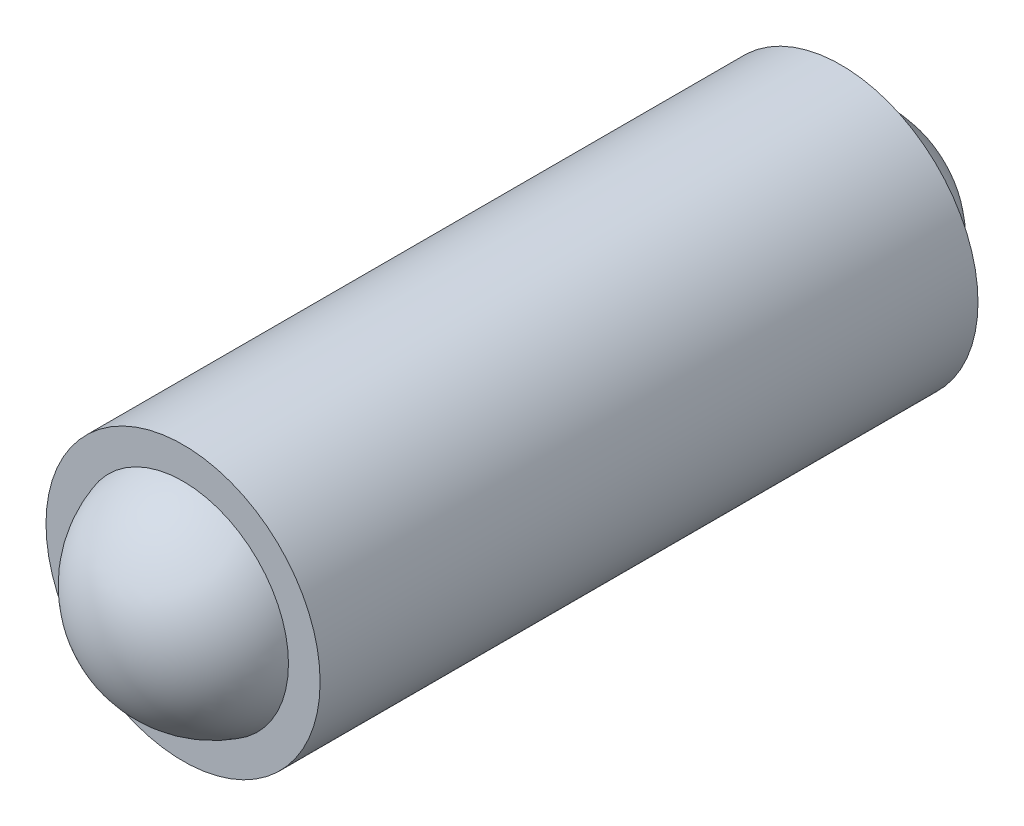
ISO-10303-21;
HEADER;
FILE_DESCRIPTION(('STEP AP214'),'2;1');
FILE_NAME('part.step','',(''),(''),'','','');
FILE_SCHEMA(('AUTOMOTIVE_DESIGN { 1 0 10303 214 1 1 1 1 }'));
ENDSEC;
DATA;
#1=APPLICATION_CONTEXT('core data for automotive mechanical design processes');
#2=APPLICATION_PROTOCOL_DEFINITION('international standard','automotive_design',2000,#1);
#3=PRODUCT_CONTEXT('',#1,'mechanical');
#4=PRODUCT('Part','Part','',(#3));
#5=PRODUCT_RELATED_PRODUCT_CATEGORY('part','',(#4));
#6=PRODUCT_DEFINITION_FORMATION('','',#4);
#7=PRODUCT_DEFINITION_CONTEXT('part definition',#1,'design');
#8=PRODUCT_DEFINITION('design','',#6,#7);
#9=PRODUCT_DEFINITION_SHAPE('','',#8);
#10=(LENGTH_UNIT() NAMED_UNIT(*) SI_UNIT(.MILLI.,.METRE.));
#11=(NAMED_UNIT(*) PLANE_ANGLE_UNIT() SI_UNIT($,.RADIAN.));
#12=(NAMED_UNIT(*) SI_UNIT($,.STERADIAN.) SOLID_ANGLE_UNIT());
#13=UNCERTAINTY_MEASURE_WITH_UNIT(LENGTH_MEASURE(1.E-05),#10,'distance_accuracy_value','');
#14=(GEOMETRIC_REPRESENTATION_CONTEXT(3) GLOBAL_UNCERTAINTY_ASSIGNED_CONTEXT((#13)) GLOBAL_UNIT_ASSIGNED_CONTEXT((#10,
#11,#12)) REPRESENTATION_CONTEXT('',''));
#15=CARTESIAN_POINT('',(0.,0.,0.));
#16=DIRECTION('',(0.,0.,1.));
#17=DIRECTION('',(1.,0.,0.));
#18=AXIS2_PLACEMENT_3D('',#15,#16,#17);
#19=CARTESIAN_POINT('',(0.,0.,-10.9));
#20=DIRECTION('',(0.,0.,1.));
#21=DIRECTION('',(0.,-1.,0.));
#22=AXIS2_PLACEMENT_3D('',#19,#20,#21);
#23=SPHERICAL_SURFACE('',#22,4.);
#24=CARTESIAN_POINT('',(0.,0.,-12.));
#25=DIRECTION('',(0.,0.,1.));
#26=DIRECTION('',(1.,0.,0.));
#27=AXIS2_PLACEMENT_3D('',#24,#25,#26);
#28=CIRCLE('',#27,3.84577690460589);
#29=CARTESIAN_POINT('',(3.84577690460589,0.,-12.));
#30=VERTEX_POINT('',#29);
#31=EDGE_CURVE('E26',#30,#30,#28,.T.);
#32=ORIENTED_EDGE('',*,*,#31,.F.);
#33=EDGE_LOOP('',(#32));
#34=FACE_BOUND('',#33,.T.);
#35=ADVANCED_FACE('F12',(#34),#23,.T.);
#36=CARTESIAN_POINT('',(0.,0.,10.9));
#37=DIRECTION('',(0.,0.,1.));
#38=DIRECTION('',(0.,1.,0.));
#39=AXIS2_PLACEMENT_3D('',#36,#37,#38);
#40=SPHERICAL_SURFACE('',#39,4.);
#41=CARTESIAN_POINT('',(0.,0.,12.));
#42=DIRECTION('',(0.,0.,1.));
#43=DIRECTION('',(1.,0.,0.));
#44=AXIS2_PLACEMENT_3D('',#41,#42,#43);
#45=CIRCLE('',#44,3.84577690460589);
#46=CARTESIAN_POINT('',(3.84577690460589,0.,12.));
#47=VERTEX_POINT('',#46);
#48=EDGE_CURVE('E8',#47,#47,#45,.T.);
#49=ORIENTED_EDGE('',*,*,#48,.T.);
#50=EDGE_LOOP('',(#49));
#51=FACE_BOUND('',#50,.T.);
#52=ADVANCED_FACE('F36',(#51),#40,.T.);
#53=CARTESIAN_POINT('',(0.,-3.84577690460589,12.));
#54=DIRECTION('',(0.,0.,1.));
#55=DIRECTION('',(1.,0.,0.));
#56=AXIS2_PLACEMENT_3D('',#53,#54,#55);
#57=PLANE('',#56);
#58=CARTESIAN_POINT('',(0.,0.,12.));
#59=DIRECTION('',(0.,0.,1.));
#60=DIRECTION('',(1.,0.,0.));
#61=AXIS2_PLACEMENT_3D('',#58,#59,#60);
#62=CIRCLE('',#61,5.);
#63=CARTESIAN_POINT('',(5.,0.,12.));
#64=VERTEX_POINT('',#63);
#65=EDGE_CURVE('E18',#64,#64,#62,.T.);
#66=ORIENTED_EDGE('',*,*,#65,.T.);
#67=EDGE_LOOP('',(#66));
#68=FACE_BOUND('',#67,.T.);
#69=ORIENTED_EDGE('',*,*,#48,.F.);
#70=EDGE_LOOP('',(#69));
#71=FACE_BOUND('',#70,.T.);
#72=ADVANCED_FACE('F42',(#68,#71),#57,.T.);
#73=CARTESIAN_POINT('',(0.,0.,7.56311397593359));
#74=DIRECTION('',(0.,0.,1.));
#75=DIRECTION('',(1.,0.,0.));
#76=AXIS2_PLACEMENT_3D('',#73,#74,#75);
#77=CYLINDRICAL_SURFACE('',#76,5.);
#78=CARTESIAN_POINT('',(0.,0.,-12.));
#79=DIRECTION('',(0.,0.,1.));
#80=DIRECTION('',(1.,0.,0.));
#81=AXIS2_PLACEMENT_3D('',#78,#79,#80);
#82=CIRCLE('',#81,5.);
#83=CARTESIAN_POINT('',(5.,0.,-12.));
#84=VERTEX_POINT('',#83);
#85=EDGE_CURVE('E22',#84,#84,#82,.T.);
#86=ORIENTED_EDGE('',*,*,#85,.T.);
#87=EDGE_LOOP('',(#86));
#88=FACE_BOUND('',#87,.T.);
#89=ORIENTED_EDGE('',*,*,#65,.F.);
#90=EDGE_LOOP('',(#89));
#91=FACE_BOUND('',#90,.T.);
#92=ADVANCED_FACE('F47',(#88,#91),#77,.T.);
#93=CARTESIAN_POINT('',(0.,-3.84577690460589,-12.));
#94=DIRECTION('',(0.,0.,-1.));
#95=DIRECTION('',(-1.,0.,0.));
#96=AXIS2_PLACEMENT_3D('',#93,#94,#95);
#97=PLANE('',#96);
#98=ORIENTED_EDGE('',*,*,#31,.T.);
#99=EDGE_LOOP('',(#98));
#100=FACE_BOUND('',#99,.T.);
#101=ORIENTED_EDGE('',*,*,#85,.F.);
#102=EDGE_LOOP('',(#101));
#103=FACE_BOUND('',#102,.T.);
#104=ADVANCED_FACE('F32',(#100,#103),#97,.T.);
#105=CLOSED_SHELL('',(#35,#52,#72,#92,#104));
#106=MANIFOLD_SOLID_BREP('B1',#105);
#107=ADVANCED_BREP_SHAPE_REPRESENTATION('',(#18,#106),#14);
#108=SHAPE_DEFINITION_REPRESENTATION(#9,#107);
ENDSEC;
END-ISO-10303-21;
